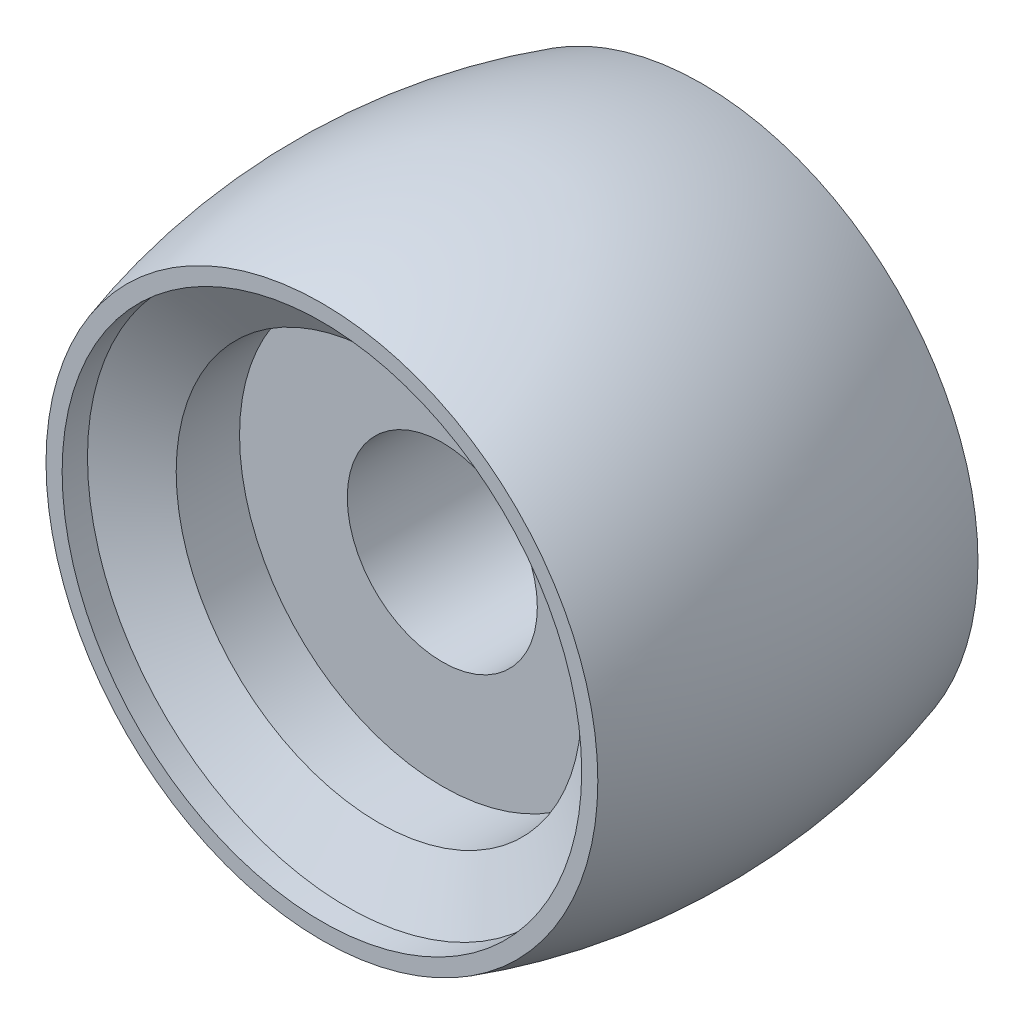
ISO-10303-21;
HEADER;
FILE_DESCRIPTION(('STEP AP214'),'2;1');
FILE_NAME('part.step','',(''),(''),'','','');
FILE_SCHEMA(('AUTOMOTIVE_DESIGN { 1 0 10303 214 1 1 1 1 }'));
ENDSEC;
DATA;
#1=APPLICATION_CONTEXT('core data for automotive mechanical design processes');
#2=APPLICATION_PROTOCOL_DEFINITION('international standard','automotive_design',2000,#1);
#3=PRODUCT_CONTEXT('',#1,'mechanical');
#4=PRODUCT('Part','Part','',(#3));
#5=PRODUCT_RELATED_PRODUCT_CATEGORY('part','',(#4));
#6=PRODUCT_DEFINITION_FORMATION('','',#4);
#7=PRODUCT_DEFINITION_CONTEXT('part definition',#1,'design');
#8=PRODUCT_DEFINITION('design','',#6,#7);
#9=PRODUCT_DEFINITION_SHAPE('','',#8);
#10=(LENGTH_UNIT() NAMED_UNIT(*) SI_UNIT(.MILLI.,.METRE.));
#11=(NAMED_UNIT(*) PLANE_ANGLE_UNIT() SI_UNIT($,.RADIAN.));
#12=(NAMED_UNIT(*) SI_UNIT($,.STERADIAN.) SOLID_ANGLE_UNIT());
#13=UNCERTAINTY_MEASURE_WITH_UNIT(LENGTH_MEASURE(1.E-05),#10,'distance_accuracy_value','');
#14=(GEOMETRIC_REPRESENTATION_CONTEXT(3) GLOBAL_UNCERTAINTY_ASSIGNED_CONTEXT((#13)) GLOBAL_UNIT_ASSIGNED_CONTEXT((#10,
#11,#12)) REPRESENTATION_CONTEXT('',''));
#15=CARTESIAN_POINT('',(0.,0.,0.));
#16=DIRECTION('',(0.,0.,1.));
#17=DIRECTION('',(1.,0.,0.));
#18=AXIS2_PLACEMENT_3D('',#15,#16,#17);
#19=CARTESIAN_POINT('',(0.,0.,-10.5));
#20=DIRECTION('',(0.,0.,-1.));
#21=DIRECTION('',(-1.,0.,0.));
#22=AXIS2_PLACEMENT_3D('',#19,#20,#21);
#23=CONICAL_SURFACE('',#22,16.,1.06369782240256);
#24=CARTESIAN_POINT('',(0.,0.,-13.));
#25=DIRECTION('',(0.,0.,1.));
#26=DIRECTION('',(1.,0.,0.));
#27=AXIS2_PLACEMENT_3D('',#24,#25,#26);
#28=CIRCLE('',#27,20.5);
#29=CARTESIAN_POINT('',(20.5,0.,-13.));
#30=VERTEX_POINT('',#29);
#31=EDGE_CURVE('E8',#30,#30,#28,.T.);
#32=ORIENTED_EDGE('',*,*,#31,.F.);
#33=EDGE_LOOP('',(#32));
#34=FACE_BOUND('',#33,.T.);
#35=CARTESIAN_POINT('',(0.,0.,-10.5));
#36=DIRECTION('',(0.,0.,1.));
#37=DIRECTION('',(1.,0.,0.));
#38=AXIS2_PLACEMENT_3D('',#35,#36,#37);
#39=CIRCLE('',#38,16.);
#40=CARTESIAN_POINT('',(16.,0.,-10.5));
#41=VERTEX_POINT('',#40);
#42=EDGE_CURVE('E37',#41,#41,#39,.T.);
#43=ORIENTED_EDGE('',*,*,#42,.T.);
#44=EDGE_LOOP('',(#43));
#45=FACE_BOUND('',#44,.T.);
#46=ADVANCED_FACE('F12',(#34,#45),#23,.F.);
#47=CARTESIAN_POINT('',(0.,0.,13.));
#48=DIRECTION('',(0.,0.,1.));
#49=DIRECTION('',(1.,0.,0.));
#50=AXIS2_PLACEMENT_3D('',#47,#48,#49);
#51=CONICAL_SURFACE('',#50,20.5,1.06369782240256);
#52=CARTESIAN_POINT('',(0.,0.,10.5));
#53=DIRECTION('',(0.,0.,1.));
#54=DIRECTION('',(1.,0.,0.));
#55=AXIS2_PLACEMENT_3D('',#52,#53,#54);
#56=CIRCLE('',#55,16.);
#57=CARTESIAN_POINT('',(16.,0.,10.5));
#58=VERTEX_POINT('',#57);
#59=EDGE_CURVE('E18',#58,#58,#56,.T.);
#60=ORIENTED_EDGE('',*,*,#59,.F.);
#61=EDGE_LOOP('',(#60));
#62=FACE_BOUND('',#61,.T.);
#63=CARTESIAN_POINT('',(0.,0.,13.));
#64=DIRECTION('',(0.,0.,1.));
#65=DIRECTION('',(1.,0.,0.));
#66=AXIS2_PLACEMENT_3D('',#63,#64,#65);
#67=CIRCLE('',#66,20.5);
#68=CARTESIAN_POINT('',(20.5,0.,13.));
#69=VERTEX_POINT('',#68);
#70=EDGE_CURVE('E40',#69,#69,#67,.F.);
#71=ORIENTED_EDGE('',*,*,#70,.F.);
#72=EDGE_LOOP('',(#71));
#73=FACE_BOUND('',#72,.T.);
#74=ADVANCED_FACE('F79',(#62,#73),#51,.F.);
#75=CARTESIAN_POINT('',(0.,0.,16.6183293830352));
#76=DIRECTION('',(0.,0.,1.));
#77=DIRECTION('',(1.,0.,0.));
#78=AXIS2_PLACEMENT_3D('',#75,#76,#77);
#79=CYLINDRICAL_SURFACE('',#78,16.);
#80=CARTESIAN_POINT('',(0.,0.,5.5));
#81=DIRECTION('',(0.,0.,1.));
#82=DIRECTION('',(1.,0.,0.));
#83=AXIS2_PLACEMENT_3D('',#80,#81,#82);
#84=CIRCLE('',#83,16.);
#85=CARTESIAN_POINT('',(16.,0.,5.5));
#86=VERTEX_POINT('',#85);
#87=EDGE_CURVE('E22',#86,#86,#84,.T.);
#88=ORIENTED_EDGE('',*,*,#87,.F.);
#89=EDGE_LOOP('',(#88));
#90=FACE_BOUND('',#89,.T.);
#91=ORIENTED_EDGE('',*,*,#59,.T.);
#92=EDGE_LOOP('',(#91));
#93=FACE_BOUND('',#92,.T.);
#94=ADVANCED_FACE('F81',(#90,#93),#79,.F.);
#95=CARTESIAN_POINT('',(0.,7.5,5.5));
#96=DIRECTION('',(0.,0.,-1.));
#97=DIRECTION('',(-1.,0.,0.));
#98=AXIS2_PLACEMENT_3D('',#95,#96,#97);
#99=PLANE('',#98);
#100=CARTESIAN_POINT('',(0.,0.,5.5));
#101=DIRECTION('',(0.,0.,1.));
#102=DIRECTION('',(1.,0.,0.));
#103=AXIS2_PLACEMENT_3D('',#100,#101,#102);
#104=CIRCLE('',#103,7.5);
#105=CARTESIAN_POINT('',(7.5,0.,5.5));
#106=VERTEX_POINT('',#105);
#107=EDGE_CURVE('E26',#106,#106,#104,.T.);
#108=ORIENTED_EDGE('',*,*,#107,.F.);
#109=EDGE_LOOP('',(#108));
#110=FACE_BOUND('',#109,.T.);
#111=ORIENTED_EDGE('',*,*,#87,.T.);
#112=EDGE_LOOP('',(#111));
#113=FACE_BOUND('',#112,.T.);
#114=ADVANCED_FACE('F90',(#110,#113),#99,.F.);
#115=CARTESIAN_POINT('',(0.,0.,16.6183293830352));
#116=DIRECTION('',(0.,0.,1.));
#117=DIRECTION('',(1.,0.,0.));
#118=AXIS2_PLACEMENT_3D('',#115,#116,#117);
#119=CYLINDRICAL_SURFACE('',#118,7.5);
#120=CARTESIAN_POINT('',(0.,0.,-5.5));
#121=DIRECTION('',(0.,0.,1.));
#122=DIRECTION('',(1.,0.,0.));
#123=AXIS2_PLACEMENT_3D('',#120,#121,#122);
#124=CIRCLE('',#123,7.5);
#125=CARTESIAN_POINT('',(7.5,0.,-5.5));
#126=VERTEX_POINT('',#125);
#127=EDGE_CURVE('E31',#126,#126,#124,.T.);
#128=ORIENTED_EDGE('',*,*,#127,.F.);
#129=EDGE_LOOP('',(#128));
#130=FACE_BOUND('',#129,.T.);
#131=ORIENTED_EDGE('',*,*,#107,.T.);
#132=EDGE_LOOP('',(#131));
#133=FACE_BOUND('',#132,.T.);
#134=ADVANCED_FACE('F149',(#130,#133),#119,.F.);
#135=CARTESIAN_POINT('',(0.,16.,-5.5));
#136=DIRECTION('',(0.,0.,1.));
#137=DIRECTION('',(1.,0.,0.));
#138=AXIS2_PLACEMENT_3D('',#135,#136,#137);
#139=PLANE('',#138);
#140=CARTESIAN_POINT('',(0.,0.,-5.5));
#141=DIRECTION('',(0.,0.,1.));
#142=DIRECTION('',(1.,0.,0.));
#143=AXIS2_PLACEMENT_3D('',#140,#141,#142);
#144=CIRCLE('',#143,16.);
#145=CARTESIAN_POINT('',(16.,0.,-5.5));
#146=VERTEX_POINT('',#145);
#147=EDGE_CURVE('E34',#146,#146,#144,.T.);
#148=ORIENTED_EDGE('',*,*,#147,.F.);
#149=EDGE_LOOP('',(#148));
#150=FACE_BOUND('',#149,.T.);
#151=ORIENTED_EDGE('',*,*,#127,.T.);
#152=EDGE_LOOP('',(#151));
#153=FACE_BOUND('',#152,.T.);
#154=ADVANCED_FACE('F141',(#150,#153),#139,.F.);
#155=CARTESIAN_POINT('',(0.,0.,16.6183293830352));
#156=DIRECTION('',(0.,0.,1.));
#157=DIRECTION('',(1.,0.,0.));
#158=AXIS2_PLACEMENT_3D('',#155,#156,#157);
#159=CYLINDRICAL_SURFACE('',#158,16.);
#160=ORIENTED_EDGE('',*,*,#42,.F.);
#161=EDGE_LOOP('',(#160));
#162=FACE_BOUND('',#161,.T.);
#163=ORIENTED_EDGE('',*,*,#147,.T.);
#164=EDGE_LOOP('',(#163));
#165=FACE_BOUND('',#164,.T.);
#166=ADVANCED_FACE('F75',(#162,#165),#159,.F.);
#167=CARTESIAN_POINT('',(0.,0.,15.));
#168=DIRECTION('',(0.,0.,-1.));
#169=DIRECTION('',(-1.,0.,0.));
#170=AXIS2_PLACEMENT_3D('',#167,#168,#169);
#171=CYLINDRICAL_SURFACE('',#170,20.5);
#172=CARTESIAN_POINT('',(0.,0.,15.));
#173=DIRECTION('',(0.,0.,-1.));
#174=DIRECTION('',(-1.,0.,0.));
#175=AXIS2_PLACEMENT_3D('',#172,#173,#174);
#176=CIRCLE('',#175,20.5);
#177=CARTESIAN_POINT('',(-20.5,0.,15.));
#178=VERTEX_POINT('',#177);
#179=EDGE_CURVE('E43',#178,#178,#176,.T.);
#180=ORIENTED_EDGE('',*,*,#179,.F.);
#181=EDGE_LOOP('',(#180));
#182=FACE_BOUND('',#181,.T.);
#183=ORIENTED_EDGE('',*,*,#70,.T.);
#184=EDGE_LOOP('',(#183));
#185=FACE_BOUND('',#184,.T.);
#186=ADVANCED_FACE('F72',(#182,#185),#171,.F.);
#187=CARTESIAN_POINT('',(0.,22.,-15.));
#188=DIRECTION('',(0.,0.,1.));
#189=DIRECTION('',(1.,0.,0.));
#190=AXIS2_PLACEMENT_3D('',#187,#188,#189);
#191=PLANE('',#190);
#192=CARTESIAN_POINT('',(0.,0.,-15.));
#193=DIRECTION('',(0.,0.,-1.));
#194=DIRECTION('',(-1.,0.,0.));
#195=AXIS2_PLACEMENT_3D('',#192,#193,#194);
#196=CIRCLE('',#195,21.7729986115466);
#197=CARTESIAN_POINT('',(-21.7729986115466,0.,-15.));
#198=VERTEX_POINT('',#197);
#199=EDGE_CURVE('E52',#198,#198,#196,.T.);
#200=ORIENTED_EDGE('',*,*,#199,.T.);
#201=EDGE_LOOP('',(#200));
#202=FACE_BOUND('',#201,.T.);
#203=CARTESIAN_POINT('',(0.,0.,-15.));
#204=DIRECTION('',(0.,0.,-1.));
#205=DIRECTION('',(-1.,0.,0.));
#206=AXIS2_PLACEMENT_3D('',#203,#204,#205);
#207=CIRCLE('',#206,20.5);
#208=CARTESIAN_POINT('',(-20.5,0.,-15.));
#209=VERTEX_POINT('',#208);
#210=EDGE_CURVE('E46',#209,#209,#207,.T.);
#211=ORIENTED_EDGE('',*,*,#210,.F.);
#212=EDGE_LOOP('',(#211));
#213=FACE_BOUND('',#212,.T.);
#214=ADVANCED_FACE('F56',(#202,#213),#191,.F.);
#215=CARTESIAN_POINT('',(0.,30.,15.));
#216=DIRECTION('',(0.,0.,-1.));
#217=DIRECTION('',(-1.,0.,0.));
#218=AXIS2_PLACEMENT_3D('',#215,#216,#217);
#219=PLANE('',#218);
#220=CARTESIAN_POINT('',(0.,0.,15.));
#221=DIRECTION('',(0.,0.,-1.));
#222=DIRECTION('',(-1.,0.,0.));
#223=AXIS2_PLACEMENT_3D('',#220,#221,#222);
#224=CIRCLE('',#223,21.7729986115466);
#225=CARTESIAN_POINT('',(-21.7729986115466,0.,15.));
#226=VERTEX_POINT('',#225);
#227=EDGE_CURVE('E49',#226,#226,#224,.T.);
#228=ORIENTED_EDGE('',*,*,#227,.F.);
#229=EDGE_LOOP('',(#228));
#230=FACE_BOUND('',#229,.T.);
#231=ORIENTED_EDGE('',*,*,#179,.T.);
#232=EDGE_LOOP('',(#231));
#233=FACE_BOUND('',#232,.T.);
#234=ADVANCED_FACE('F66',(#230,#233),#219,.F.);
#235=ORIENTED_EDGE('',*,*,#210,.T.);
#236=EDGE_LOOP('',(#235));
#237=FACE_BOUND('',#236,.T.);
#238=ORIENTED_EDGE('',*,*,#31,.T.);
#239=EDGE_LOOP('',(#238));
#240=FACE_BOUND('',#239,.T.);
#241=ADVANCED_FACE('F62',(#237,#240),#171,.F.);
#242=CARTESIAN_POINT('',(0.,0.,0.));
#243=DIRECTION('',(0.,0.,-1.));
#244=DIRECTION('',(-1.,0.,0.));
#245=AXIS2_PLACEMENT_3D('',#242,#243,#244);
#246=DEGENERATE_TOROIDAL_SURFACE('',#245,27.6298589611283,51.6298589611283,.F.);
#247=ORIENTED_EDGE('',*,*,#199,.F.);
#248=EDGE_LOOP('',(#247));
#249=FACE_BOUND('',#248,.T.);
#250=ORIENTED_EDGE('',*,*,#227,.T.);
#251=EDGE_LOOP('',(#250));
#252=FACE_BOUND('',#251,.T.);
#253=ADVANCED_FACE('F59',(#249,#252),#246,.F.);
#254=CLOSED_SHELL('',(#46,#74,#94,#114,#134,#154,#166,#186,#214,#234,#241,#253));
#255=MANIFOLD_SOLID_BREP('B1',#254);
#256=ADVANCED_BREP_SHAPE_REPRESENTATION('',(#18,#255),#14);
#257=SHAPE_DEFINITION_REPRESENTATION(#9,#256);
ENDSEC;
END-ISO-10303-21;
